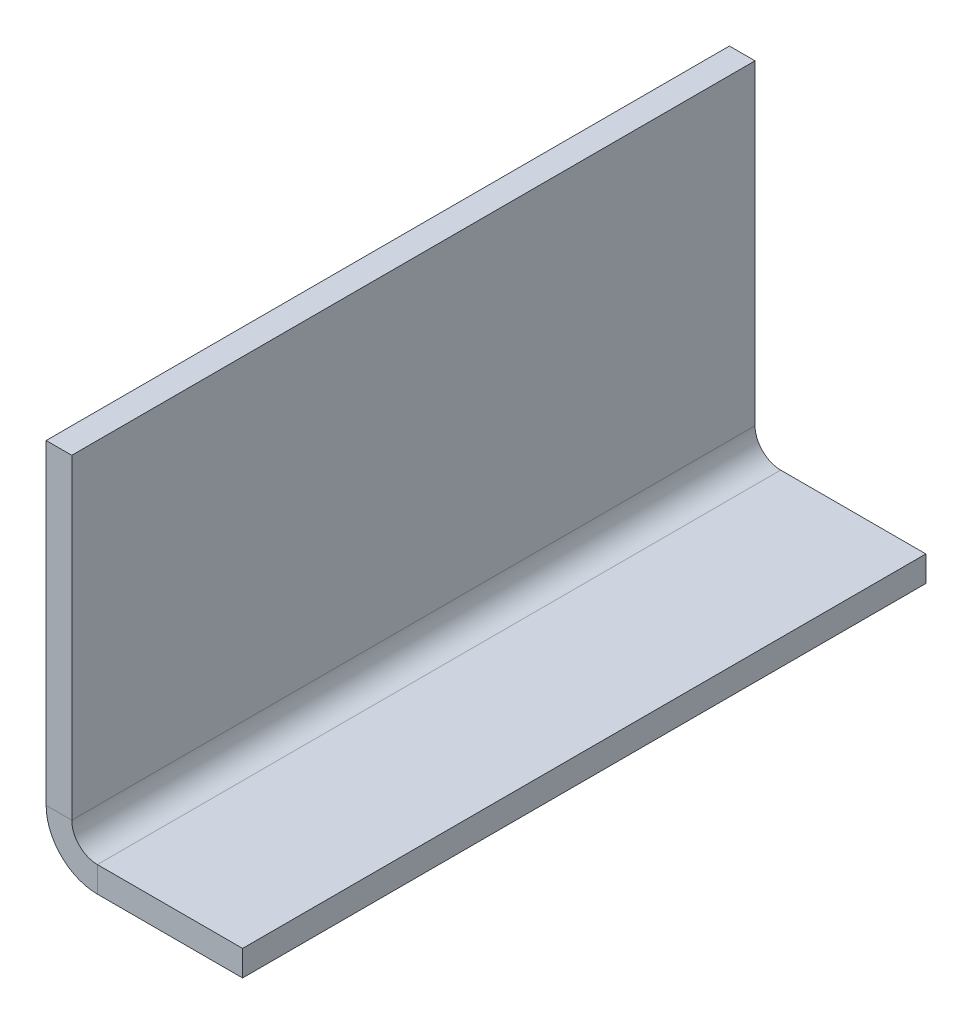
ISO-10303-21;
HEADER;
FILE_DESCRIPTION(('STEP AP214'),'2;1');
FILE_NAME('part.step','',(''),(''),'','','');
FILE_SCHEMA(('AUTOMOTIVE_DESIGN { 1 0 10303 214 1 1 1 1 }'));
ENDSEC;
DATA;
#1=APPLICATION_CONTEXT('core data for automotive mechanical design processes');
#2=APPLICATION_PROTOCOL_DEFINITION('international standard','automotive_design',2000,#1);
#3=PRODUCT_CONTEXT('',#1,'mechanical');
#4=PRODUCT('Part','Part','',(#3));
#5=PRODUCT_RELATED_PRODUCT_CATEGORY('part','',(#4));
#6=PRODUCT_DEFINITION_FORMATION('','',#4);
#7=PRODUCT_DEFINITION_CONTEXT('part definition',#1,'design');
#8=PRODUCT_DEFINITION('design','',#6,#7);
#9=PRODUCT_DEFINITION_SHAPE('','',#8);
#10=(LENGTH_UNIT() NAMED_UNIT(*) SI_UNIT(.MILLI.,.METRE.));
#11=(NAMED_UNIT(*) PLANE_ANGLE_UNIT() SI_UNIT($,.RADIAN.));
#12=(NAMED_UNIT(*) SI_UNIT($,.STERADIAN.) SOLID_ANGLE_UNIT());
#13=UNCERTAINTY_MEASURE_WITH_UNIT(LENGTH_MEASURE(1.E-05),#10,'distance_accuracy_value','');
#14=(GEOMETRIC_REPRESENTATION_CONTEXT(3) GLOBAL_UNCERTAINTY_ASSIGNED_CONTEXT((#13)) GLOBAL_UNIT_ASSIGNED_CONTEXT((#10,
#11,#12)) REPRESENTATION_CONTEXT('',''));
#15=CARTESIAN_POINT('',(0.,0.,0.));
#16=DIRECTION('',(0.,0.,1.));
#17=DIRECTION('',(1.,0.,0.));
#18=AXIS2_PLACEMENT_3D('',#15,#16,#17);
#19=CARTESIAN_POINT('',(3.,0.,40.));
#20=DIRECTION('',(0.,0.,1.));
#21=DIRECTION('',(1.,0.,0.));
#22=AXIS2_PLACEMENT_3D('',#19,#20,#21);
#23=PLANE('',#22);
#24=DIRECTION('',(0.,-1.,0.));
#25=VECTOR('',#24,1.);
#26=CARTESIAN_POINT('',(3.,0.,40.));
#27=LINE('',#26,#25);
#28=CARTESIAN_POINT('',(3.,0.,40.));
#29=VERTEX_POINT('',#28);
#30=CARTESIAN_POINT('',(3.,-3.,40.));
#31=VERTEX_POINT('',#30);
#32=EDGE_CURVE('E11',#29,#31,#27,.T.);
#33=ORIENTED_EDGE('',*,*,#32,.F.);
#34=CARTESIAN_POINT('',(3.,3.,40.));
#35=DIRECTION('',(0.,0.,-1.));
#36=DIRECTION('',(-1.,0.,0.));
#37=AXIS2_PLACEMENT_3D('',#34,#35,#36);
#38=CIRCLE('',#37,3.);
#39=CARTESIAN_POINT('',(0.,3.,40.));
#40=VERTEX_POINT('',#39);
#41=EDGE_CURVE('E132',#40,#29,#38,.F.);
#42=ORIENTED_EDGE('',*,*,#41,.F.);
#43=DIRECTION('',(1.,0.,0.));
#44=VECTOR('',#43,1.);
#45=CARTESIAN_POINT('',(-3.,3.,40.));
#46=LINE('',#45,#44);
#47=CARTESIAN_POINT('',(-3.,3.,40.));
#48=VERTEX_POINT('',#47);
#49=EDGE_CURVE('E43',#48,#40,#46,.T.);
#50=ORIENTED_EDGE('',*,*,#49,.F.);
#51=CARTESIAN_POINT('',(3.,3.,40.));
#52=DIRECTION('',(0.,0.,1.));
#53=DIRECTION('',(1.,0.,0.));
#54=AXIS2_PLACEMENT_3D('',#51,#52,#53);
#55=CIRCLE('',#54,6.);
#56=EDGE_CURVE('E125',#48,#31,#55,.T.);
#57=ORIENTED_EDGE('',*,*,#56,.T.);
#58=EDGE_LOOP('',(#33,#42,#50,#57));
#59=FACE_BOUND('',#58,.T.);
#60=ADVANCED_FACE('F35',(#59),#23,.T.);
#61=CARTESIAN_POINT('',(-3.,3.,40.));
#62=DIRECTION('',(0.,0.,1.));
#63=DIRECTION('',(1.,0.,0.));
#64=AXIS2_PLACEMENT_3D('',#61,#62,#63);
#65=PLANE('',#64);
#66=DIRECTION('',(1.,0.,0.));
#67=VECTOR('',#66,1.);
#68=CARTESIAN_POINT('',(0.,0.,40.));
#69=LINE('',#68,#67);
#70=CARTESIAN_POINT('',(20.,0.,40.));
#71=VERTEX_POINT('',#70);
#72=EDGE_CURVE('E181',#29,#71,#69,.T.);
#73=ORIENTED_EDGE('',*,*,#72,.F.);
#74=ORIENTED_EDGE('',*,*,#32,.T.);
#75=DIRECTION('',(1.,0.,0.));
#76=VECTOR('',#75,1.);
#77=CARTESIAN_POINT('',(0.,-3.,40.));
#78=LINE('',#77,#76);
#79=CARTESIAN_POINT('',(20.,-3.,40.));
#80=VERTEX_POINT('',#79);
#81=EDGE_CURVE('E91',#31,#80,#78,.T.);
#82=ORIENTED_EDGE('',*,*,#81,.T.);
#83=DIRECTION('',(0.,-1.,0.));
#84=VECTOR('',#83,1.);
#85=CARTESIAN_POINT('',(20.,0.,40.));
#86=LINE('',#85,#84);
#87=EDGE_CURVE('E338',#71,#80,#86,.T.);
#88=ORIENTED_EDGE('',*,*,#87,.F.);
#89=EDGE_LOOP('',(#73,#74,#82,#88));
#90=FACE_BOUND('',#89,.T.);
#91=ADVANCED_FACE('F189',(#90),#65,.T.);
#92=CARTESIAN_POINT('',(0.,3.,-40.));
#93=DIRECTION('',(0.,0.,-1.));
#94=DIRECTION('',(-1.,0.,0.));
#95=AXIS2_PLACEMENT_3D('',#92,#93,#94);
#96=PLANE('',#95);
#97=DIRECTION('',(-1.,0.,0.));
#98=VECTOR('',#97,1.);
#99=CARTESIAN_POINT('',(0.,3.,-40.));
#100=LINE('',#99,#98);
#101=CARTESIAN_POINT('',(0.,3.,-40.));
#102=VERTEX_POINT('',#101);
#103=CARTESIAN_POINT('',(-3.,3.,-40.));
#104=VERTEX_POINT('',#103);
#105=EDGE_CURVE('E78',#102,#104,#100,.T.);
#106=ORIENTED_EDGE('',*,*,#105,.F.);
#107=CARTESIAN_POINT('',(3.,3.,-40.));
#108=DIRECTION('',(0.,0.,-1.));
#109=DIRECTION('',(-1.,0.,0.));
#110=AXIS2_PLACEMENT_3D('',#107,#108,#109);
#111=CIRCLE('',#110,3.);
#112=CARTESIAN_POINT('',(3.,0.,-40.));
#113=VERTEX_POINT('',#112);
#114=EDGE_CURVE('E147',#102,#113,#111,.F.);
#115=ORIENTED_EDGE('',*,*,#114,.T.);
#116=DIRECTION('',(0.,1.,0.));
#117=VECTOR('',#116,1.);
#118=CARTESIAN_POINT('',(3.,-3.,-40.));
#119=LINE('',#118,#117);
#120=CARTESIAN_POINT('',(3.,-3.,-40.));
#121=VERTEX_POINT('',#120);
#122=EDGE_CURVE('E85',#121,#113,#119,.T.);
#123=ORIENTED_EDGE('',*,*,#122,.F.);
#124=CARTESIAN_POINT('',(3.,3.,-40.));
#125=DIRECTION('',(0.,0.,1.));
#126=DIRECTION('',(1.,0.,0.));
#127=AXIS2_PLACEMENT_3D('',#124,#125,#126);
#128=CIRCLE('',#127,6.);
#129=EDGE_CURVE('E154',#104,#121,#128,.T.);
#130=ORIENTED_EDGE('',*,*,#129,.F.);
#131=EDGE_LOOP('',(#106,#115,#123,#130));
#132=FACE_BOUND('',#131,.T.);
#133=ADVANCED_FACE('F187',(#132),#96,.T.);
#134=CARTESIAN_POINT('',(3.,-3.,-40.));
#135=DIRECTION('',(0.,0.,-1.));
#136=DIRECTION('',(-1.,0.,0.));
#137=AXIS2_PLACEMENT_3D('',#134,#135,#136);
#138=PLANE('',#137);
#139=DIRECTION('',(0.,-1.,0.));
#140=VECTOR('',#139,1.);
#141=CARTESIAN_POINT('',(0.,40.,-40.));
#142=LINE('',#141,#140);
#143=CARTESIAN_POINT('',(0.,40.,-40.));
#144=VERTEX_POINT('',#143);
#145=EDGE_CURVE('E149',#144,#102,#142,.T.);
#146=ORIENTED_EDGE('',*,*,#145,.T.);
#147=ORIENTED_EDGE('',*,*,#105,.T.);
#148=DIRECTION('',(0.,-1.,0.));
#149=VECTOR('',#148,1.);
#150=CARTESIAN_POINT('',(-3.,40.,-40.));
#151=LINE('',#150,#149);
#152=CARTESIAN_POINT('',(-3.,40.,-40.));
#153=VERTEX_POINT('',#152);
#154=EDGE_CURVE('E152',#153,#104,#151,.T.);
#155=ORIENTED_EDGE('',*,*,#154,.F.);
#156=DIRECTION('',(1.,0.,0.));
#157=VECTOR('',#156,1.);
#158=CARTESIAN_POINT('',(-3.,40.,-40.));
#159=LINE('',#158,#157);
#160=EDGE_CURVE('E113',#153,#144,#159,.T.);
#161=ORIENTED_EDGE('',*,*,#160,.T.);
#162=EDGE_LOOP('',(#146,#147,#155,#161));
#163=FACE_BOUND('',#162,.T.);
#164=ADVANCED_FACE('F183',(#163),#138,.T.);
#165=CARTESIAN_POINT('',(0.,-3.,40.));
#166=DIRECTION('',(0.,1.,0.));
#167=DIRECTION('',(0.,0.,1.));
#168=AXIS2_PLACEMENT_3D('',#165,#166,#167);
#169=PLANE('',#168);
#170=DIRECTION('',(1.,0.,0.));
#171=VECTOR('',#170,1.);
#172=CARTESIAN_POINT('',(0.,-3.,-40.));
#173=LINE('',#172,#171);
#174=CARTESIAN_POINT('',(20.,-3.,-40.));
#175=VERTEX_POINT('',#174);
#176=EDGE_CURVE('E138',#121,#175,#173,.T.);
#177=ORIENTED_EDGE('',*,*,#176,.T.);
#178=DIRECTION('',(0.,0.,-1.));
#179=VECTOR('',#178,1.);
#180=CARTESIAN_POINT('',(20.,-3.,40.));
#181=LINE('',#180,#179);
#182=EDGE_CURVE('E168',#80,#175,#181,.T.);
#183=ORIENTED_EDGE('',*,*,#182,.F.);
#184=ORIENTED_EDGE('',*,*,#81,.F.);
#185=DIRECTION('',(0.,0.,-1.));
#186=VECTOR('',#185,1.);
#187=CARTESIAN_POINT('',(3.,-3.,40.));
#188=LINE('',#187,#186);
#189=EDGE_CURVE('E137',#31,#121,#188,.T.);
#190=ORIENTED_EDGE('',*,*,#189,.T.);
#191=EDGE_LOOP('',(#177,#183,#184,#190));
#192=FACE_BOUND('',#191,.T.);
#193=ADVANCED_FACE('F195',(#192),#169,.F.);
#194=CARTESIAN_POINT('',(20.,0.,40.));
#195=DIRECTION('',(1.,0.,0.));
#196=DIRECTION('',(0.,0.,-1.));
#197=AXIS2_PLACEMENT_3D('',#194,#195,#196);
#198=PLANE('',#197);
#199=DIRECTION('',(0.,-1.,0.));
#200=VECTOR('',#199,1.);
#201=CARTESIAN_POINT('',(20.,0.,-40.));
#202=LINE('',#201,#200);
#203=CARTESIAN_POINT('',(20.,0.,-40.));
#204=VERTEX_POINT('',#203);
#205=EDGE_CURVE('E141',#204,#175,#202,.T.);
#206=ORIENTED_EDGE('',*,*,#205,.F.);
#207=DIRECTION('',(0.,0.,-1.));
#208=VECTOR('',#207,1.);
#209=CARTESIAN_POINT('',(20.,0.,40.));
#210=LINE('',#209,#208);
#211=EDGE_CURVE('E166',#71,#204,#210,.T.);
#212=ORIENTED_EDGE('',*,*,#211,.F.);
#213=ORIENTED_EDGE('',*,*,#87,.T.);
#214=ORIENTED_EDGE('',*,*,#182,.T.);
#215=EDGE_LOOP('',(#206,#212,#213,#214));
#216=FACE_BOUND('',#215,.T.);
#217=ADVANCED_FACE('F226',(#216),#198,.T.);
#218=CARTESIAN_POINT('',(0.,0.,40.));
#219=DIRECTION('',(0.,1.,0.));
#220=DIRECTION('',(0.,0.,1.));
#221=AXIS2_PLACEMENT_3D('',#218,#219,#220);
#222=PLANE('',#221);
#223=DIRECTION('',(1.,0.,0.));
#224=VECTOR('',#223,1.);
#225=CARTESIAN_POINT('',(0.,0.,-40.));
#226=LINE('',#225,#224);
#227=EDGE_CURVE('E144',#113,#204,#226,.T.);
#228=ORIENTED_EDGE('',*,*,#227,.F.);
#229=DIRECTION('',(0.,0.,-1.));
#230=VECTOR('',#229,1.);
#231=CARTESIAN_POINT('',(3.,0.,40.));
#232=LINE('',#231,#230);
#233=EDGE_CURVE('E163',#29,#113,#232,.T.);
#234=ORIENTED_EDGE('',*,*,#233,.F.);
#235=ORIENTED_EDGE('',*,*,#72,.T.);
#236=ORIENTED_EDGE('',*,*,#211,.T.);
#237=EDGE_LOOP('',(#228,#234,#235,#236));
#238=FACE_BOUND('',#237,.T.);
#239=ADVANCED_FACE('F237',(#238),#222,.T.);
#240=CARTESIAN_POINT('',(3.,3.,40.));
#241=DIRECTION('',(0.,0.,-1.));
#242=DIRECTION('',(-1.,0.,0.));
#243=AXIS2_PLACEMENT_3D('',#240,#241,#242);
#244=CYLINDRICAL_SURFACE('',#243,3.);
#245=ORIENTED_EDGE('',*,*,#114,.F.);
#246=DIRECTION('',(0.,0.,-1.));
#247=VECTOR('',#246,1.);
#248=CARTESIAN_POINT('',(0.,3.,40.));
#249=LINE('',#248,#247);
#250=EDGE_CURVE('E160',#40,#102,#249,.T.);
#251=ORIENTED_EDGE('',*,*,#250,.F.);
#252=ORIENTED_EDGE('',*,*,#41,.T.);
#253=ORIENTED_EDGE('',*,*,#233,.T.);
#254=EDGE_LOOP('',(#245,#251,#252,#253));
#255=FACE_BOUND('',#254,.T.);
#256=ADVANCED_FACE('F177',(#255),#244,.F.);
#257=CARTESIAN_POINT('',(0.,40.,40.));
#258=DIRECTION('',(1.,0.,0.));
#259=DIRECTION('',(0.,1.,0.));
#260=AXIS2_PLACEMENT_3D('',#257,#258,#259);
#261=PLANE('',#260);
#262=ORIENTED_EDGE('',*,*,#145,.F.);
#263=DIRECTION('',(0.,0.,-1.));
#264=VECTOR('',#263,1.);
#265=CARTESIAN_POINT('',(0.,40.,40.));
#266=LINE('',#265,#264);
#267=CARTESIAN_POINT('',(0.,40.,40.));
#268=VERTEX_POINT('',#267);
#269=EDGE_CURVE('E115',#268,#144,#266,.T.);
#270=ORIENTED_EDGE('',*,*,#269,.F.);
#271=DIRECTION('',(0.,-1.,0.));
#272=VECTOR('',#271,1.);
#273=CARTESIAN_POINT('',(0.,40.,40.));
#274=LINE('',#273,#272);
#275=EDGE_CURVE('E130',#268,#40,#274,.T.);
#276=ORIENTED_EDGE('',*,*,#275,.T.);
#277=ORIENTED_EDGE('',*,*,#250,.T.);
#278=EDGE_LOOP('',(#262,#270,#276,#277));
#279=FACE_BOUND('',#278,.T.);
#280=ADVANCED_FACE('F182',(#279),#261,.T.);
#281=CARTESIAN_POINT('',(-3.,40.,40.));
#282=DIRECTION('',(0.,1.,0.));
#283=DIRECTION('',(0.,0.,1.));
#284=AXIS2_PLACEMENT_3D('',#281,#282,#283);
#285=PLANE('',#284);
#286=ORIENTED_EDGE('',*,*,#160,.F.);
#287=DIRECTION('',(0.,0.,-1.));
#288=VECTOR('',#287,1.);
#289=CARTESIAN_POINT('',(-3.,40.,40.));
#290=LINE('',#289,#288);
#291=CARTESIAN_POINT('',(-3.,40.,40.));
#292=VERTEX_POINT('',#291);
#293=EDGE_CURVE('E107',#292,#153,#290,.T.);
#294=ORIENTED_EDGE('',*,*,#293,.F.);
#295=DIRECTION('',(1.,0.,0.));
#296=VECTOR('',#295,1.);
#297=CARTESIAN_POINT('',(-3.,40.,40.));
#298=LINE('',#297,#296);
#299=EDGE_CURVE('E111',#292,#268,#298,.T.);
#300=ORIENTED_EDGE('',*,*,#299,.T.);
#301=ORIENTED_EDGE('',*,*,#269,.T.);
#302=EDGE_LOOP('',(#286,#294,#300,#301));
#303=FACE_BOUND('',#302,.T.);
#304=ADVANCED_FACE('F109',(#303),#285,.T.);
#305=CARTESIAN_POINT('',(-3.,40.,40.));
#306=DIRECTION('',(1.,0.,0.));
#307=DIRECTION('',(0.,1.,0.));
#308=AXIS2_PLACEMENT_3D('',#305,#306,#307);
#309=PLANE('',#308);
#310=ORIENTED_EDGE('',*,*,#154,.T.);
#311=DIRECTION('',(0.,0.,-1.));
#312=VECTOR('',#311,1.);
#313=CARTESIAN_POINT('',(-3.,3.,40.));
#314=LINE('',#313,#312);
#315=EDGE_CURVE('E116',#48,#104,#314,.T.);
#316=ORIENTED_EDGE('',*,*,#315,.F.);
#317=DIRECTION('',(0.,-1.,0.));
#318=VECTOR('',#317,1.);
#319=CARTESIAN_POINT('',(-3.,40.,40.));
#320=LINE('',#319,#318);
#321=EDGE_CURVE('E120',#292,#48,#320,.T.);
#322=ORIENTED_EDGE('',*,*,#321,.F.);
#323=ORIENTED_EDGE('',*,*,#293,.T.);
#324=EDGE_LOOP('',(#310,#316,#322,#323));
#325=FACE_BOUND('',#324,.T.);
#326=ADVANCED_FACE('F121',(#325),#309,.F.);
#327=CARTESIAN_POINT('',(3.,3.,40.));
#328=DIRECTION('',(0.,0.,-1.));
#329=DIRECTION('',(-1.,0.,0.));
#330=AXIS2_PLACEMENT_3D('',#327,#328,#329);
#331=CYLINDRICAL_SURFACE('',#330,6.);
#332=ORIENTED_EDGE('',*,*,#129,.T.);
#333=ORIENTED_EDGE('',*,*,#189,.F.);
#334=ORIENTED_EDGE('',*,*,#56,.F.);
#335=ORIENTED_EDGE('',*,*,#315,.T.);
#336=EDGE_LOOP('',(#332,#333,#334,#335));
#337=FACE_BOUND('',#336,.T.);
#338=ADVANCED_FACE('F185',(#337),#331,.T.);
#339=CARTESIAN_POINT('',(3.,3.,40.));
#340=DIRECTION('',(0.,0.,-1.));
#341=DIRECTION('',(-1.,0.,0.));
#342=AXIS2_PLACEMENT_3D('',#339,#340,#341);
#343=PLANE('',#342);
#344=ORIENTED_EDGE('',*,*,#321,.T.);
#345=ORIENTED_EDGE('',*,*,#49,.T.);
#346=ORIENTED_EDGE('',*,*,#275,.F.);
#347=ORIENTED_EDGE('',*,*,#299,.F.);
#348=EDGE_LOOP('',(#344,#345,#346,#347));
#349=FACE_BOUND('',#348,.T.);
#350=ADVANCED_FACE('F128',(#349),#343,.F.);
#351=CARTESIAN_POINT('',(3.,3.,-40.));
#352=DIRECTION('',(0.,0.,-1.));
#353=DIRECTION('',(-1.,0.,0.));
#354=AXIS2_PLACEMENT_3D('',#351,#352,#353);
#355=PLANE('',#354);
#356=ORIENTED_EDGE('',*,*,#176,.F.);
#357=ORIENTED_EDGE('',*,*,#122,.T.);
#358=ORIENTED_EDGE('',*,*,#227,.T.);
#359=ORIENTED_EDGE('',*,*,#205,.T.);
#360=EDGE_LOOP('',(#356,#357,#358,#359));
#361=FACE_BOUND('',#360,.T.);
#362=ADVANCED_FACE('F303',(#361),#355,.T.);
#363=CLOSED_SHELL('',(#60,#91,#133,#164,#193,#217,#239,#256,#280,#304,#326,#338,#350,#362));
#364=MANIFOLD_SOLID_BREP('B2',#363);
#365=ADVANCED_BREP_SHAPE_REPRESENTATION('',(#18,#364),#14);
#366=SHAPE_DEFINITION_REPRESENTATION(#9,#365);
ENDSEC;
END-ISO-10303-21;
